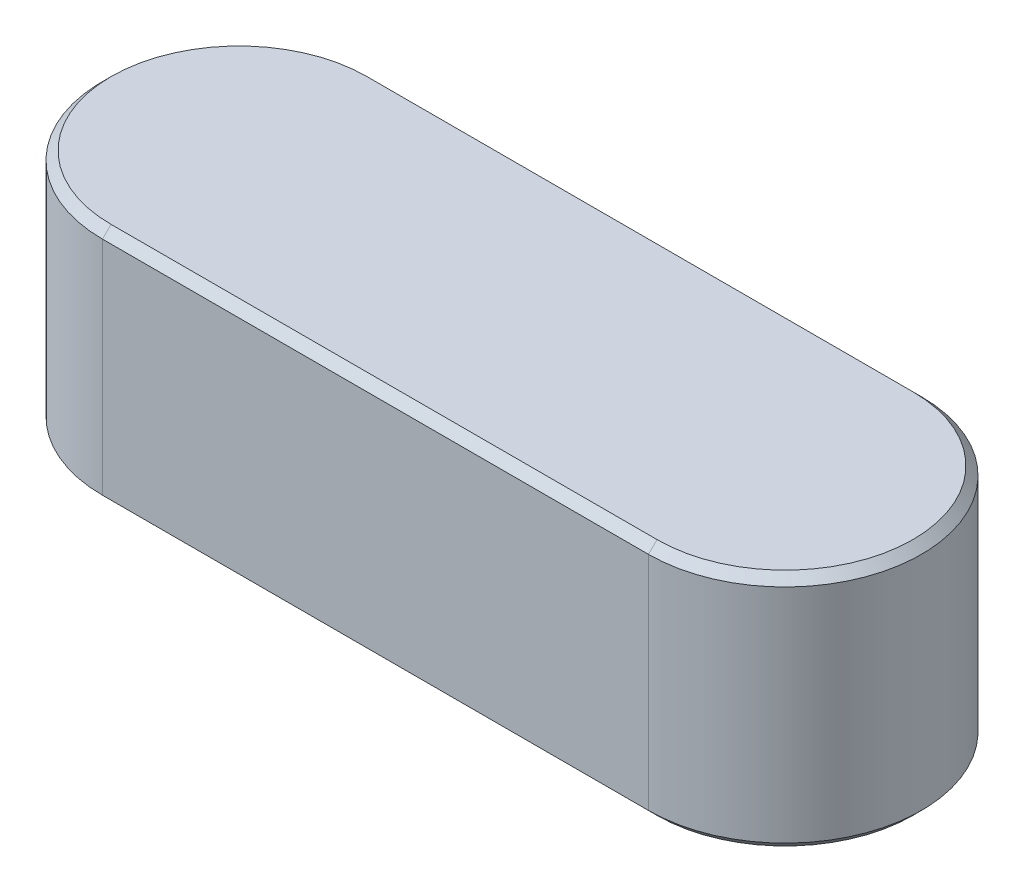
from build123d import *

# Parameters (mm, degrees)
BASE_EXTRUSION_DEPTH = 7
CHANFREIN1_SIZE      = 0.25


with BuildPart() as part:
    # Esquisse1 → Base-Extrusion (new body)
    with BuildSketch(Plane(origin=(0, 0, 0), x_dir=(1, 0, 0), z_dir=(0, 1, 0))):
        with BuildLine():
            Line((16, 4), (0, 4))
            ThreePointArc((0, 4), (-4, 0), (0, -4))
            Line((0, -4), (16, -4))
            ThreePointArc((16, -4), (20, 0), (16, 4))
        make_face()
    extrude(amount=BASE_EXTRUSION_DEPTH)

    # Chanfrein1
    chanfrein1_edges = [part.edges().sort_by_distance(p)[0] for p in [
        (20, 7, 0),
        (8, 7, -4),
        (-4, 7, 0),
        (8, 0, -4),
        (20, 0, 0),
        (8, 0, 4),
        (-4, 0, 0),
        (8, 7, 4),
    ]]
    chamfer(chanfrein1_edges, length=CHANFREIN1_SIZE)


solid = part.part
